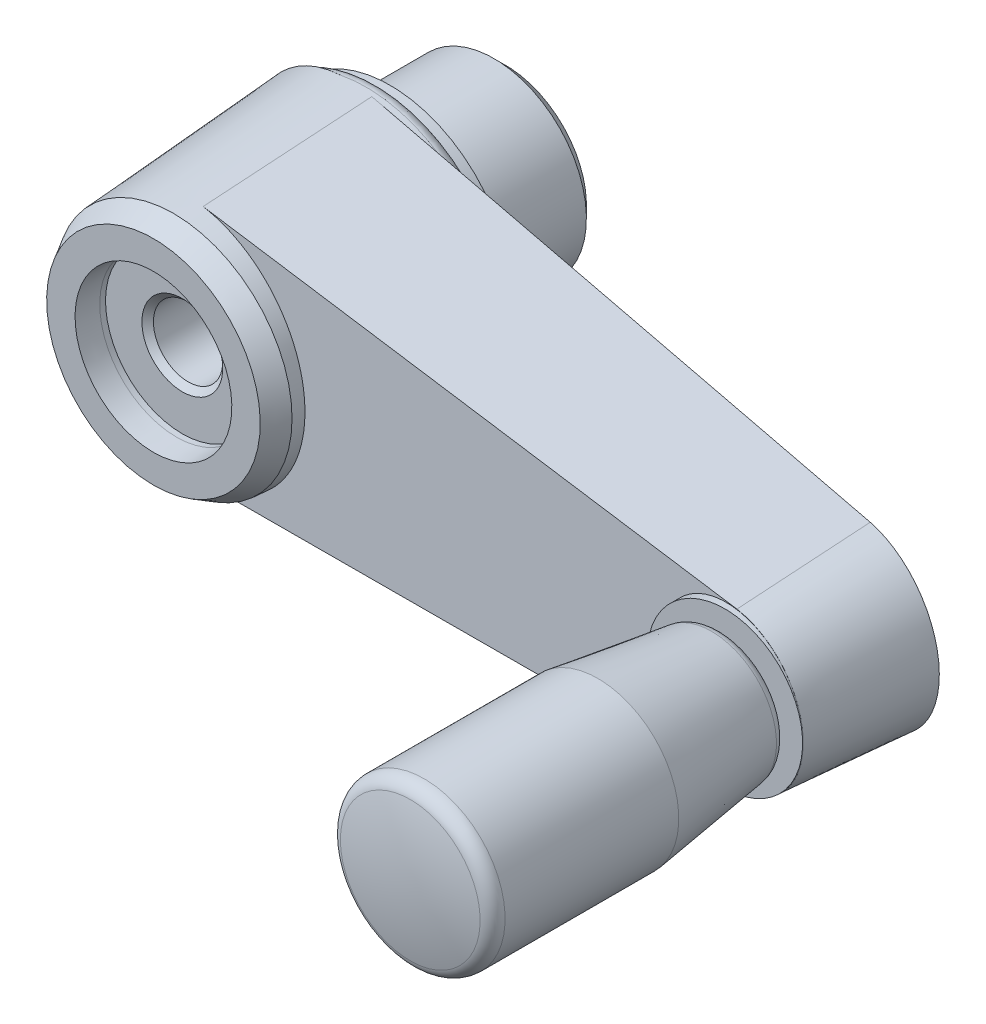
ISO-10303-21;
HEADER;
FILE_DESCRIPTION(('STEP AP214'),'2;1');
FILE_NAME('part.step','',(''),(''),'','','');
FILE_SCHEMA(('AUTOMOTIVE_DESIGN { 1 0 10303 214 1 1 1 1 }'));
ENDSEC;
DATA;
#1=APPLICATION_CONTEXT('core data for automotive mechanical design processes');
#2=APPLICATION_PROTOCOL_DEFINITION('international standard','automotive_design',2000,#1);
#3=PRODUCT_CONTEXT('',#1,'mechanical');
#4=PRODUCT('Part','Part','',(#3));
#5=PRODUCT_RELATED_PRODUCT_CATEGORY('part','',(#4));
#6=PRODUCT_DEFINITION_FORMATION('','',#4);
#7=PRODUCT_DEFINITION_CONTEXT('part definition',#1,'design');
#8=PRODUCT_DEFINITION('design','',#6,#7);
#9=PRODUCT_DEFINITION_SHAPE('','',#8);
#10=(LENGTH_UNIT() NAMED_UNIT(*) SI_UNIT(.MILLI.,.METRE.));
#11=(NAMED_UNIT(*) PLANE_ANGLE_UNIT() SI_UNIT($,.RADIAN.));
#12=(NAMED_UNIT(*) SI_UNIT($,.STERADIAN.) SOLID_ANGLE_UNIT());
#13=UNCERTAINTY_MEASURE_WITH_UNIT(LENGTH_MEASURE(1.E-05),#10,'distance_accuracy_value','');
#14=(GEOMETRIC_REPRESENTATION_CONTEXT(3) GLOBAL_UNCERTAINTY_ASSIGNED_CONTEXT((#13)) GLOBAL_UNIT_ASSIGNED_CONTEXT((#10,
#11,#12)) REPRESENTATION_CONTEXT('',''));
#15=CARTESIAN_POINT('',(0.,0.,0.));
#16=DIRECTION('',(0.,0.,1.));
#17=DIRECTION('',(1.,0.,0.));
#18=AXIS2_PLACEMENT_3D('',#15,#16,#17);
#19=CARTESIAN_POINT('',(-9.25,0.,30.4999999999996));
#20=DIRECTION('',(0.,0.,-1.));
#21=DIRECTION('',(0.,1.,0.));
#22=AXIS2_PLACEMENT_3D('',#19,#20,#21);
#23=PLANE('',#22);
#24=CARTESIAN_POINT('',(0.,0.,30.4999999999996));
#25=DIRECTION('',(0.,0.,1.));
#26=DIRECTION('',(0.,-1.,0.));
#27=AXIS2_PLACEMENT_3D('',#24,#25,#26);
#28=CIRCLE('',#27,9.25);
#29=CARTESIAN_POINT('',(0.,-9.25,30.4999999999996));
#30=VERTEX_POINT('',#29);
#31=EDGE_CURVE('E305',#30,#30,#28,.T.);
#32=ORIENTED_EDGE('',*,*,#31,.T.);
#33=EDGE_LOOP('',(#32));
#34=FACE_BOUND('',#33,.T.);
#35=CARTESIAN_POINT('',(0.,0.,30.4999999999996));
#36=DIRECTION('',(0.,0.,1.));
#37=DIRECTION('',(0.,-1.,0.));
#38=AXIS2_PLACEMENT_3D('',#35,#36,#37);
#39=CIRCLE('',#38,6.78985362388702);
#40=CARTESIAN_POINT('',(0.,-6.78985362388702,30.4999999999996));
#41=VERTEX_POINT('',#40);
#42=EDGE_CURVE('E329',#41,#41,#39,.T.);
#43=ORIENTED_EDGE('',*,*,#42,.F.);
#44=EDGE_LOOP('',(#43));
#45=FACE_BOUND('',#44,.T.);
#46=ADVANCED_FACE('F14',(#34,#45),#23,.F.);
#47=CARTESIAN_POINT('',(-11.5,-11.5,10.8686434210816));
#48=DIRECTION('',(-0.130237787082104,0.,0.99148278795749));
#49=DIRECTION('',(-0.99148278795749,0.,-0.130237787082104));
#50=AXIS2_PLACEMENT_3D('',#47,#48,#49);
#51=PLANE('',#50);
#52=CARTESIAN_POINT('',(-0.104670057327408,0.,12.3654949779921));
#53=DIRECTION('',(-0.130237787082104,0.,0.99148278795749));
#54=DIRECTION('',(-0.99148278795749,0.,-0.130237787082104));
#55=AXIS2_PLACEMENT_3D('',#52,#53,#54);
#56=ELLIPSE('',#55,11.4932201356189,11.394849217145);
#57=CARTESIAN_POINT('',(0.911596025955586,11.3494439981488,12.4989882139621));
#58=VERTEX_POINT('',#57);
#59=CARTESIAN_POINT('',(0.911596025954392,-11.3494439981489,12.4989882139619));
#60=VERTEX_POINT('',#59);
#61=EDGE_CURVE('E251',#58,#60,#56,.F.);
#62=ORIENTED_EDGE('',*,*,#61,.F.);
#63=DIRECTION('',(-0.988624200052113,0.0758813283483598,-0.129862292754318));
#64=VECTOR('',#63,1.);
#65=CARTESIAN_POINT('',(-9.71441205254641,12.1650376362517,11.1031921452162));
#66=LINE('',#65,#64);
#67=CARTESIAN_POINT('',(50.608289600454,7.53500052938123,19.0269758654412));
#68=VERTEX_POINT('',#67);
#69=EDGE_CURVE('E234',#68,#58,#66,.T.);
#70=ORIENTED_EDGE('',*,*,#69,.F.);
#71=CARTESIAN_POINT('',(49.930506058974,0.,18.9379445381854));
#72=DIRECTION('',(-0.130237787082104,0.,0.99148278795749));
#73=DIRECTION('',(-0.99148278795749,0.,-0.130237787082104));
#74=AXIS2_PLACEMENT_3D('',#71,#72,#73);
#75=ELLIPSE('',#74,7.63073206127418,7.56542032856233);
#76=CARTESIAN_POINT('',(50.608289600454,-7.53500052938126,19.0269758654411));
#77=VERTEX_POINT('',#76);
#78=EDGE_CURVE('E98',#68,#77,#75,.F.);
#79=ORIENTED_EDGE('',*,*,#78,.T.);
#80=DIRECTION('',(0.988624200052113,0.0758813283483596,0.129862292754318));
#81=VECTOR('',#80,1.);
#82=CARTESIAN_POINT('',(-11.4398287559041,-12.2974710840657,10.8765473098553));
#83=LINE('',#82,#81);
#84=EDGE_CURVE('E94',#77,#60,#83,.F.);
#85=ORIENTED_EDGE('',*,*,#84,.T.);
#86=EDGE_LOOP('',(#62,#70,#79,#85));
#87=FACE_BOUND('',#86,.T.);
#88=ADVANCED_FACE('F123',(#87),#51,.F.);
#89=CARTESIAN_POINT('',(56.7298365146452,-11.5,30.9460983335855));
#90=DIRECTION('',(0.0697564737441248,0.,-0.997564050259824));
#91=DIRECTION('',(0.997564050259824,0.,0.0697564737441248));
#92=AXIS2_PLACEMENT_3D('',#89,#90,#91);
#93=PLANE('',#92);
#94=CARTESIAN_POINT('',(-0.0507248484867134,0.,26.975614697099));
#95=DIRECTION('',(0.0697564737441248,0.,-0.997564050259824));
#96=DIRECTION('',(-0.997564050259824,0.,-0.0697564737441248));
#97=AXIS2_PLACEMENT_3D('',#94,#95,#96);
#98=ELLIPSE('',#97,10.3990223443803,10.3735668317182);
#99=CARTESIAN_POINT('',(0.836486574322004,-10.3355582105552,27.0376545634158));
#100=VERTEX_POINT('',#99);
#101=CARTESIAN_POINT('',(0.836486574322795,10.3355582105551,27.0376545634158));
#102=VERTEX_POINT('',#101);
#103=EDGE_CURVE('E84',#100,#102,#98,.F.);
#104=ORIENTED_EDGE('',*,*,#103,.F.);
#105=DIRECTION('',(-0.994968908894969,-0.072084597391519,-0.0695750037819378));
#106=VECTOR('',#105,1.);
#107=CARTESIAN_POINT('',(56.355888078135,-6.31322779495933,30.9199493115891));
#108=LINE('',#107,#106);
#109=CARTESIAN_POINT('',(50.5487553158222,-6.7339493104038,30.5138750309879));
#110=VERTEX_POINT('',#109);
#111=EDGE_CURVE('E232',#100,#110,#108,.F.);
#112=ORIENTED_EDGE('',*,*,#111,.T.);
#113=CARTESIAN_POINT('',(49.9669495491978,0.,30.4731912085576));
#114=DIRECTION('',(0.0697564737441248,0.,-0.997564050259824));
#115=DIRECTION('',(-0.997564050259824,0.,-0.0697564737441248));
#116=AXIS2_PLACEMENT_3D('',#113,#114,#115);
#117=ELLIPSE('',#116,6.77562154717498,6.7590356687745);
#118=CARTESIAN_POINT('',(56.7191173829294,-0.306403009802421,30.9453487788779));
#119=VERTEX_POINT('',#118);
#120=EDGE_CURVE('E229',#110,#119,#117,.F.);
#121=ORIENTED_EDGE('',*,*,#120,.T.);
#122=CARTESIAN_POINT('',(50.,0.,30.4755023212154));
#123=DIRECTION('',(0.0697564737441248,0.,-0.997564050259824));
#124=DIRECTION('',(0.997564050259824,0.,0.0697564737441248));
#125=AXIS2_PLACEMENT_3D('',#122,#123,#124);
#126=ELLIPSE('',#125,6.74252445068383,6.7261);
#127=CARTESIAN_POINT('',(56.719117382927,0.306403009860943,30.9453487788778));
#128=VERTEX_POINT('',#127);
#129=EDGE_CURVE('E93',#119,#128,#126,.T.);
#130=ORIENTED_EDGE('',*,*,#129,.T.);
#131=CARTESIAN_POINT('',(50.5487553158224,6.73394931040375,30.5138750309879));
#132=VERTEX_POINT('',#131);
#133=EDGE_CURVE('E228',#128,#132,#117,.F.);
#134=ORIENTED_EDGE('',*,*,#133,.T.);
#135=DIRECTION('',(0.994968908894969,-0.0720845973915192,0.0695750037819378));
#136=VECTOR('',#135,1.);
#137=CARTESIAN_POINT('',(58.0054925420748,6.19371544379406,31.0353008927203));
#138=LINE('',#137,#136);
#139=EDGE_CURVE('E225',#102,#132,#138,.T.);
#140=ORIENTED_EDGE('',*,*,#139,.F.);
#141=EDGE_LOOP('',(#104,#112,#121,#130,#134,#140));
#142=FACE_BOUND('',#141,.T.);
#143=ADVANCED_FACE('F182',(#142),#93,.F.);
#144=CARTESIAN_POINT('',(0.,0.,10.8686434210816));
#145=DIRECTION('',(0.,0.,-1.));
#146=DIRECTION('',(0.,-1.,0.));
#147=AXIS2_PLACEMENT_3D('',#144,#145,#146);
#148=CONICAL_SURFACE('',#147,11.5,0.0698131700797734);
#149=CARTESIAN_POINT('',(-0.104670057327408,0.,12.3654949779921));
#150=DIRECTION('',(-0.130237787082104,0.,0.99148278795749));
#151=DIRECTION('',(-0.99148278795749,0.,-0.130237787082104));
#152=AXIS2_PLACEMENT_3D('',#149,#150,#151);
#153=ELLIPSE('',#152,11.4932201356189,11.3948492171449);
#154=CARTESIAN_POINT('',(-2.2077738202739,-11.1991033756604,12.089238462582));
#155=VERTEX_POINT('',#154);
#156=CARTESIAN_POINT('',(-2.2077738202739,11.1991033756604,12.089238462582));
#157=VERTEX_POINT('',#156);
#158=EDGE_CURVE('E90',#155,#157,#153,.F.);
#159=ORIENTED_EDGE('',*,*,#158,.F.);
#160=CARTESIAN_POINT('',(0.,0.,12.089238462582));
#161=DIRECTION('',(0.,0.,1.));
#162=DIRECTION('',(0.,-1.,0.));
#163=AXIS2_PLACEMENT_3D('',#160,#161,#162);
#164=CIRCLE('',#163,11.4146476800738);
#165=EDGE_CURVE('E80',#155,#157,#164,.T.);
#166=ORIENTED_EDGE('',*,*,#165,.T.);
#167=EDGE_LOOP('',(#159,#166));
#168=FACE_BOUND('',#167,.T.);
#169=CARTESIAN_POINT('',(0.816240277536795,10.0629979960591,30.9460983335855));
#170=CARTESIAN_POINT('',(0.833583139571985,10.2963518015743,27.5998558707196));
#171=CARTESIAN_POINT('',(0.850901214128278,10.5297072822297,24.2536133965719));
#172=CARTESIAN_POINT('',(0.885487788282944,10.9964215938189,17.5611284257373));
#173=CARTESIAN_POINT('',(0.902756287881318,11.2297804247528,14.2148859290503));
#174=CARTESIAN_POINT('',(0.920000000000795,11.4631409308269,10.8686434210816));
#175=B_SPLINE_CURVE_WITH_KNOTS('',3,(#169,#170,#171,#172,#173,#174),.UNSPECIFIED.,.F.,.F.,(4,2,
4),(0.,10.0632420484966,20.1264840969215),.UNSPECIFIED.);
#176=EDGE_CURVE('E194',#102,#58,#175,.T.);
#177=ORIENTED_EDGE('',*,*,#176,.T.);
#178=ORIENTED_EDGE('',*,*,#61,.T.);
#179=CARTESIAN_POINT('',(0.816240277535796,-10.0629979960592,30.9460983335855));
#180=CARTESIAN_POINT('',(0.833583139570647,-10.2963518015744,27.5998558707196));
#181=CARTESIAN_POINT('',(0.850901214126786,-10.5297072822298,24.2536133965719));
#182=CARTESIAN_POINT('',(0.885487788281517,-10.9964215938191,17.5611284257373));
#183=CARTESIAN_POINT('',(0.902756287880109,-11.229780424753,14.2148859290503));
#184=CARTESIAN_POINT('',(0.91999999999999,-11.463140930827,10.8686434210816));
#185=B_SPLINE_CURVE_WITH_KNOTS('',3,(#179,#180,#181,#182,#183,#184),.UNSPECIFIED.,.F.,.F.,(4,2,
4),(0.,10.0632420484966,20.1264840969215),.UNSPECIFIED.);
#186=EDGE_CURVE('E187',#100,#60,#185,.T.);
#187=ORIENTED_EDGE('',*,*,#186,.F.);
#188=ORIENTED_EDGE('',*,*,#103,.T.);
#189=EDGE_LOOP('',(#177,#178,#187,#188));
#190=FACE_BOUND('',#189,.T.);
#191=CARTESIAN_POINT('',(0.,0.,28.7444762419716));
#192=DIRECTION('',(0.,0.,1.));
#193=DIRECTION('',(0.,-1.,0.));
#194=AXIS2_PLACEMENT_3D('',#191,#192,#193);
#195=CIRCLE('',#194,10.25);
#196=CARTESIAN_POINT('',(0.,-10.25,28.7444762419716));
#197=VERTEX_POINT('',#196);
#198=EDGE_CURVE('E91',#197,#197,#195,.T.);
#199=ORIENTED_EDGE('',*,*,#198,.F.);
#200=EDGE_LOOP('',(#199));
#201=FACE_BOUND('',#200,.T.);
#202=ADVANCED_FACE('F88',(#168,#190,#201),#148,.T.);
#203=CARTESIAN_POINT('',(0.91999999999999,-11.4631409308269,10.8686434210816));
#204=DIRECTION('',(0.0672304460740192,-0.995295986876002,0.0697564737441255));
#205=DIRECTION('',(0.,-0.0699146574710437,-0.997552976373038));
#206=AXIS2_PLACEMENT_3D('',#203,#204,#205);
#207=PLANE('',#206);
#208=ORIENTED_EDGE('',*,*,#111,.F.);
#209=ORIENTED_EDGE('',*,*,#186,.T.);
#210=ORIENTED_EDGE('',*,*,#84,.F.);
#211=CARTESIAN_POINT('',(50.5465090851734,-6.70380816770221,30.9460983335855));
#212=CARTESIAN_POINT('',(50.5682362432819,-6.99540068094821,26.7646715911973));
#213=CARTESIAN_POINT('',(50.5899069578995,-7.28699700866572,22.5832448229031));
#214=CARTESIAN_POINT('',(50.6245011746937,-7.75371080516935,15.8907598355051));
#215=CARTESIAN_POINT('',(50.6374607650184,-7.9288258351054,13.3797016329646));
#216=CARTESIAN_POINT('',(50.6504,-8.10394224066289,10.8686434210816));
#217=B_SPLINE_CURVE_WITH_KNOTS('',3,(#211,#212,#213,#214,#215,#216),.UNSPECIFIED.,.F.,.F.,(4,2,
4),(0.,12.5749135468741,20.1264841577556),.UNSPECIFIED.);
#218=EDGE_CURVE('E218',#110,#77,#217,.T.);
#219=ORIENTED_EDGE('',*,*,#218,.F.);
#220=EDGE_LOOP('',(#208,#209,#210,#219));
#221=FACE_BOUND('',#220,.T.);
#222=ADVANCED_FACE('F181',(#221),#207,.T.);
#223=CARTESIAN_POINT('',(50.,0.,10.8686434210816));
#224=DIRECTION('',(0.,0.,-1.));
#225=DIRECTION('',(0.,-1.,0.));
#226=AXIS2_PLACEMENT_3D('',#223,#224,#225);
#227=CONICAL_SURFACE('',#226,8.13,0.0698131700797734);
#228=ORIENTED_EDGE('',*,*,#133,.F.);
#229=CARTESIAN_POINT('',(50.,0.,30.9453487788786));
#230=DIRECTION('',(0.,0.,-1.));
#231=DIRECTION('',(0.,1.,0.));
#232=AXIS2_PLACEMENT_3D('',#229,#230,#231);
#233=CIRCLE('',#232,6.7261);
#234=EDGE_CURVE('E42',#128,#119,#233,.T.);
#235=ORIENTED_EDGE('',*,*,#234,.T.);
#236=ORIENTED_EDGE('',*,*,#120,.F.);
#237=ORIENTED_EDGE('',*,*,#218,.T.);
#238=ORIENTED_EDGE('',*,*,#78,.F.);
#239=CARTESIAN_POINT('',(50.5465090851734,6.70380816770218,30.9460983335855));
#240=CARTESIAN_POINT('',(50.5682362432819,6.99540068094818,26.7646715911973));
#241=CARTESIAN_POINT('',(50.5899069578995,7.28699700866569,22.5832448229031));
#242=CARTESIAN_POINT('',(50.6245011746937,7.75371080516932,15.8907598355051));
#243=CARTESIAN_POINT('',(50.6374607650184,7.92882583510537,13.3797016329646));
#244=CARTESIAN_POINT('',(50.6504,8.10394224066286,10.8686434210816));
#245=B_SPLINE_CURVE_WITH_KNOTS('',3,(#239,#240,#241,#242,#243,#244),.UNSPECIFIED.,.F.,.F.,(4,2,
4),(0.,12.5749135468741,20.1264841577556),.UNSPECIFIED.);
#246=EDGE_CURVE('E201',#132,#68,#245,.T.);
#247=ORIENTED_EDGE('',*,*,#246,.F.);
#248=EDGE_LOOP('',(#228,#235,#236,#237,#238,#247));
#249=FACE_BOUND('',#248,.T.);
#250=ADVANCED_FACE('F211',(#249),#227,.T.);
#251=CARTESIAN_POINT('',(0.91999999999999,11.4631409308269,10.8686434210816));
#252=DIRECTION('',(0.0672304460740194,0.995295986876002,0.0697564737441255));
#253=DIRECTION('',(0.,-0.0699146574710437,0.997552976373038));
#254=AXIS2_PLACEMENT_3D('',#251,#252,#253);
#255=PLANE('',#254);
#256=ORIENTED_EDGE('',*,*,#176,.F.);
#257=ORIENTED_EDGE('',*,*,#139,.T.);
#258=ORIENTED_EDGE('',*,*,#246,.T.);
#259=ORIENTED_EDGE('',*,*,#69,.T.);
#260=EDGE_LOOP('',(#256,#257,#258,#259));
#261=FACE_BOUND('',#260,.T.);
#262=ADVANCED_FACE('F208',(#261),#255,.T.);
#263=CARTESIAN_POINT('',(0.,0.,12.3792440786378));
#264=DIRECTION('',(-0.130237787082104,0.,0.99148278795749));
#265=DIRECTION('',(0.99148278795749,0.,0.130237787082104));
#266=AXIS2_PLACEMENT_3D('',#263,#264,#265);
#267=ELLIPSE('',#266,10.5901989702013,10.4999999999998);
#268=CARTESIAN_POINT('',(-10.3254713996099,-1.90647328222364,11.0229254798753));
#269=VERTEX_POINT('',#268);
#270=CARTESIAN_POINT('',(-10.3254713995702,1.90647328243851,11.0229254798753));
#271=VERTEX_POINT('',#270);
#272=EDGE_CURVE('E28',#269,#271,#267,.F.);
#273=ORIENTED_EDGE('',*,*,#272,.F.);
#274=CARTESIAN_POINT('',(-10.2868458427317,0.,11.0279992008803));
#275=CARTESIAN_POINT('',(-10.2889229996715,-0.0186180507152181,11.0277263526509));
#276=CARTESIAN_POINT('',(-10.2909504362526,-0.037242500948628,11.0274600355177));
#277=CARTESIAN_POINT('',(-10.328292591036,-0.389018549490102,11.0225548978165));
#278=CARTESIAN_POINT('',(-10.3477502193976,-0.724105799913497,11.0199990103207));
#279=CARTESIAN_POINT('',(-10.3545534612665,-1.39492341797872,11.0191053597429));
#280=CARTESIAN_POINT('',(-10.341851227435,-1.73065400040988,11.0207738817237));
#281=CARTESIAN_POINT('',(-10.2630896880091,-2.64423253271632,11.0311197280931));
#282=CARTESIAN_POINT('',(-10.1648024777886,-3.21958493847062,11.044030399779));
#283=CARTESIAN_POINT('',(-9.87339886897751,-4.34599471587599,11.0823081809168));
#284=CARTESIAN_POINT('',(-9.68019036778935,-4.89702792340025,11.1076873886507));
#285=CARTESIAN_POINT('',(-9.32372276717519,-5.69192330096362,11.1545117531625));
#286=CARTESIAN_POINT('',(-9.19387776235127,-5.95148315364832,11.1715677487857));
#287=CARTESIAN_POINT('',(-8.91281276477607,-6.45851450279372,11.2084874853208));
#288=CARTESIAN_POINT('',(-8.76160056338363,-6.7059903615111,11.2283502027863));
#289=CARTESIAN_POINT('',(-8.43881444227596,-7.18704333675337,11.2707502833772));
#290=CARTESIAN_POINT('',(-8.26723934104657,-7.42061964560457,11.2932878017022));
#291=CARTESIAN_POINT('',(-7.90498341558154,-7.87204819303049,11.3408725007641));
#292=CARTESIAN_POINT('',(-7.71430968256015,-8.08990621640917,11.3659187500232));
#293=CARTESIAN_POINT('',(-7.31726644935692,-8.50610364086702,11.4180729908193));
#294=CARTESIAN_POINT('',(-7.1110854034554,-8.70462595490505,11.4451562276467));
#295=CARTESIAN_POINT('',(-6.6827093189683,-9.08324402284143,11.5014262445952));
#296=CARTESIAN_POINT('',(-6.46051433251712,-9.2633398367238,11.5306130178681));
#297=CARTESIAN_POINT('',(-6.00167551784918,-9.60370566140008,11.5908845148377));
#298=CARTESIAN_POINT('',(-5.76503215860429,-9.76397631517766,11.6219691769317));
#299=CARTESIAN_POINT('',(-5.27897465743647,-10.0634190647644,11.6858160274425));
#300=CARTESIAN_POINT('',(-5.02956099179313,-10.2025919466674,11.7185781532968));
#301=CARTESIAN_POINT('',(-4.52357238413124,-10.456772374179,11.7850430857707));
#302=CARTESIAN_POINT('',(-4.2671609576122,-10.5721110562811,11.8187244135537));
#303=CARTESIAN_POINT('',(-3.74549893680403,-10.7802282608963,11.8872481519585));
#304=CARTESIAN_POINT('',(-3.4802487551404,-10.8730078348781,11.9220905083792));
#305=CARTESIAN_POINT('',(-2.94240262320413,-11.0352705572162,11.9927401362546));
#306=CARTESIAN_POINT('',(-2.66979649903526,-11.1047194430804,12.0285487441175));
#307=CARTESIAN_POINT('',(-2.1195682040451,-11.2194337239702,12.1008248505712));
#308=CARTESIAN_POINT('',(-1.84194493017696,-11.2646937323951,12.1372924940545));
#309=CARTESIAN_POINT('',(-1.56285300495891,-11.297493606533,12.1739530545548));
#310=B_SPLINE_CURVE_WITH_KNOTS('',3,(#274,#275,#276,#277,#278,#279,#280,#281,#282,#283,#284,
#285,#286,#287,#288,#289,#290,#291,#292,#293,#294,#295,#296,#297,#298,#299,#300,#301,#302,#303,
#304,#305,#306,#307,#308,#309),.UNSPECIFIED.,.F.,.F.,(4,2,2,2,2,2,2,2,2,2,2,2,2,2,2,2,2,4),(0.,
0.0562087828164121,1.06131769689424,2.06792288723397,3.81068822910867,5.55514793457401,
6.42645227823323,7.29743972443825,8.16847773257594,9.03919351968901,9.90065083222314,
10.7621053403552,11.6235319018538,12.4849263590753,13.3334011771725,14.1818364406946,
15.0315122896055,15.8813772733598),.UNSPECIFIED.);
#311=EDGE_CURVE('E9',#269,#155,#310,.T.);
#312=ORIENTED_EDGE('',*,*,#311,.T.);
#313=ORIENTED_EDGE('',*,*,#158,.T.);
#314=CARTESIAN_POINT('',(-10.2868458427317,0.,11.0279992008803));
#315=CARTESIAN_POINT('',(-10.2889229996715,0.0186180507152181,11.0277263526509));
#316=CARTESIAN_POINT('',(-10.2909504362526,0.037242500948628,11.0274600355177));
#317=CARTESIAN_POINT('',(-10.328292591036,0.389018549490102,11.0225548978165));
#318=CARTESIAN_POINT('',(-10.3477502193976,0.724105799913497,11.0199990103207));
#319=CARTESIAN_POINT('',(-10.3545534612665,1.39492341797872,11.0191053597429));
#320=CARTESIAN_POINT('',(-10.341851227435,1.73065400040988,11.0207738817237));
#321=CARTESIAN_POINT('',(-10.2630896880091,2.64423253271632,11.0311197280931));
#322=CARTESIAN_POINT('',(-10.1648024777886,3.21958493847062,11.044030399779));
#323=CARTESIAN_POINT('',(-9.87339886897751,4.34599471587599,11.0823081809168));
#324=CARTESIAN_POINT('',(-9.68019036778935,4.89702792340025,11.1076873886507));
#325=CARTESIAN_POINT('',(-9.32372276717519,5.69192330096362,11.1545117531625));
#326=CARTESIAN_POINT('',(-9.19387776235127,5.95148315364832,11.1715677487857));
#327=CARTESIAN_POINT('',(-8.91281276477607,6.45851450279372,11.2084874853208));
#328=CARTESIAN_POINT('',(-8.76160056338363,6.7059903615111,11.2283502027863));
#329=CARTESIAN_POINT('',(-8.43881444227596,7.18704333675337,11.2707502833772));
#330=CARTESIAN_POINT('',(-8.26723934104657,7.42061964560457,11.2932878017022));
#331=CARTESIAN_POINT('',(-7.90498341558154,7.87204819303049,11.3408725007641));
#332=CARTESIAN_POINT('',(-7.71430968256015,8.08990621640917,11.3659187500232));
#333=CARTESIAN_POINT('',(-7.31726644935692,8.50610364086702,11.4180729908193));
#334=CARTESIAN_POINT('',(-7.1110854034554,8.70462595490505,11.4451562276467));
#335=CARTESIAN_POINT('',(-6.6827093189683,9.08324402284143,11.5014262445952));
#336=CARTESIAN_POINT('',(-6.46051433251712,9.2633398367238,11.5306130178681));
#337=CARTESIAN_POINT('',(-6.00167551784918,9.60370566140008,11.5908845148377));
#338=CARTESIAN_POINT('',(-5.76503215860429,9.76397631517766,11.6219691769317));
#339=CARTESIAN_POINT('',(-5.27897465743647,10.0634190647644,11.6858160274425));
#340=CARTESIAN_POINT('',(-5.02956099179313,10.2025919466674,11.7185781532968));
#341=CARTESIAN_POINT('',(-4.52357238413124,10.456772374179,11.7850430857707));
#342=CARTESIAN_POINT('',(-4.2671609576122,10.5721110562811,11.8187244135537));
#343=CARTESIAN_POINT('',(-3.74549893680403,10.7802282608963,11.8872481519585));
#344=CARTESIAN_POINT('',(-3.4802487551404,10.8730078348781,11.9220905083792));
#345=CARTESIAN_POINT('',(-2.94240262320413,11.0352705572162,11.9927401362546));
#346=CARTESIAN_POINT('',(-2.66979649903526,11.1047194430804,12.0285487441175));
#347=CARTESIAN_POINT('',(-2.1195682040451,11.2194337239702,12.1008248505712));
#348=CARTESIAN_POINT('',(-1.84194493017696,11.2646937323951,12.1372924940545));
#349=CARTESIAN_POINT('',(-1.56285300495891,11.297493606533,12.1739530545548));
#350=B_SPLINE_CURVE_WITH_KNOTS('',3,(#314,#315,#316,#317,#318,#319,#320,#321,#322,#323,#324,
#325,#326,#327,#328,#329,#330,#331,#332,#333,#334,#335,#336,#337,#338,#339,#340,#341,#342,#343,
#344,#345,#346,#347,#348,#349),.UNSPECIFIED.,.F.,.F.,(4,2,2,2,2,2,2,2,2,2,2,2,2,2,2,2,2,4),(0.,
0.0562087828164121,1.06131769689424,2.06792288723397,3.81068822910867,5.55514793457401,
6.42645227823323,7.29743972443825,8.16847773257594,9.03919351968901,9.90065083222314,
10.7621053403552,11.6235319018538,12.4849263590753,13.3334011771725,14.1818364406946,
15.0315122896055,15.8813772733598),.UNSPECIFIED.);
#351=EDGE_CURVE('E77',#157,#271,#350,.F.);
#352=ORIENTED_EDGE('',*,*,#351,.T.);
#353=EDGE_LOOP('',(#273,#312,#313,#352));
#354=FACE_BOUND('',#353,.T.);
#355=ADVANCED_FACE('F16',(#354),#51,.F.);
#356=CARTESIAN_POINT('',(50.,0.,59.));
#357=DIRECTION('',(0.,0.,1.));
#358=DIRECTION('',(-1.,0.,0.));
#359=AXIS2_PLACEMENT_3D('',#356,#357,#358);
#360=CYLINDRICAL_SURFACE('',#359,6.7261);
#361=CARTESIAN_POINT('',(50.,0.,30.9999999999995));
#362=DIRECTION('',(0.,0.,1.));
#363=DIRECTION('',(-1.,0.,0.));
#364=AXIS2_PLACEMENT_3D('',#361,#362,#363);
#365=CIRCLE('',#364,6.7261);
#366=CARTESIAN_POINT('',(43.2739,0.,30.9999999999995));
#367=VERTEX_POINT('',#366);
#368=EDGE_CURVE('E252',#367,#367,#365,.T.);
#369=ORIENTED_EDGE('',*,*,#368,.F.);
#370=EDGE_LOOP('',(#369));
#371=FACE_BOUND('',#370,.T.);
#372=ORIENTED_EDGE('',*,*,#234,.F.);
#373=ORIENTED_EDGE('',*,*,#129,.F.);
#374=EDGE_LOOP('',(#372,#373));
#375=FACE_BOUND('',#374,.T.);
#376=ADVANCED_FACE('F143',(#371,#375),#360,.T.);
#377=CARTESIAN_POINT('',(50.,0.,33.9999999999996));
#378=DIRECTION('',(0.,-1.,0.));
#379=DIRECTION('',(1.,0.,0.));
#380=AXIS2_PLACEMENT_3D('',#377,#378,#379);
#381=SPHERICAL_SURFACE('',#380,25.);
#382=CARTESIAN_POINT('',(50.,0.,33.9999999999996));
#383=DIRECTION('',(0.,0.,1.));
#384=DIRECTION('',(-1.,0.,0.));
#385=AXIS2_PLACEMENT_3D('',#382,#383,#384);
#386=SPHERICAL_SURFACE('',#385,25.);
#387=CARTESIAN_POINT('',(50.,0.,58.2562497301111));
#388=DIRECTION('',(0.,0.,1.));
#389=DIRECTION('',(-1.,0.,0.));
#390=AXIS2_PLACEMENT_3D('',#387,#388,#389);
#391=CIRCLE('',#390,6.05263157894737);
#392=CARTESIAN_POINT('',(43.9473684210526,0.,58.2562497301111));
#393=VERTEX_POINT('',#392);
#394=EDGE_CURVE('E280',#393,#393,#391,.T.);
#395=ORIENTED_EDGE('',*,*,#394,.T.);
#396=EDGE_LOOP('',(#395));
#397=FACE_BOUND('',#396,.T.);
#398=ADVANCED_FACE('F146',(#397),#386,.T.);
#399=CARTESIAN_POINT('',(50.,0.,57.0434372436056));
#400=DIRECTION('',(0.,0.,1.));
#401=DIRECTION('',(-1.,0.,0.));
#402=AXIS2_PLACEMENT_3D('',#399,#400,#401);
#403=TOROIDAL_SURFACE('',#402,5.75,1.25);
#404=CARTESIAN_POINT('',(50.,0.,57.0434372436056));
#405=DIRECTION('',(0.,0.,1.));
#406=DIRECTION('',(-1.,0.,0.));
#407=AXIS2_PLACEMENT_3D('',#404,#405,#406);
#408=CIRCLE('',#407,7.);
#409=CARTESIAN_POINT('',(43.,0.,57.0434372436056));
#410=VERTEX_POINT('',#409);
#411=EDGE_CURVE('E277',#410,#410,#408,.T.);
#412=ORIENTED_EDGE('',*,*,#411,.T.);
#413=EDGE_LOOP('',(#412));
#414=FACE_BOUND('',#413,.T.);
#415=ORIENTED_EDGE('',*,*,#394,.F.);
#416=EDGE_LOOP('',(#415));
#417=FACE_BOUND('',#416,.T.);
#418=ADVANCED_FACE('F170',(#414,#417),#403,.T.);
#419=CARTESIAN_POINT('',(50.,0.,59.));
#420=DIRECTION('',(0.,0.,1.));
#421=DIRECTION('',(-1.,0.,0.));
#422=AXIS2_PLACEMENT_3D('',#419,#420,#421);
#423=CYLINDRICAL_SURFACE('',#422,7.);
#424=ORIENTED_EDGE('',*,*,#411,.F.);
#425=EDGE_LOOP('',(#424));
#426=FACE_BOUND('',#425,.T.);
#427=CARTESIAN_POINT('',(50.,0.,41.9999999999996));
#428=DIRECTION('',(0.,0.,1.));
#429=DIRECTION('',(-1.,0.,0.));
#430=AXIS2_PLACEMENT_3D('',#427,#428,#429);
#431=CIRCLE('',#430,7.00000000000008);
#432=CARTESIAN_POINT('',(42.9999999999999,0.,41.9999999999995));
#433=VERTEX_POINT('',#432);
#434=EDGE_CURVE('E274',#433,#433,#431,.T.);
#435=ORIENTED_EDGE('',*,*,#434,.T.);
#436=EDGE_LOOP('',(#435));
#437=FACE_BOUND('',#436,.T.);
#438=ADVANCED_FACE('F166',(#426,#437),#423,.T.);
#439=CARTESIAN_POINT('',(50.,0.,41.9999999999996));
#440=DIRECTION('',(0.,0.,1.));
#441=DIRECTION('',(-1.,0.,0.));
#442=AXIS2_PLACEMENT_3D('',#439,#440,#441);
#443=CONICAL_SURFACE('',#442,7.00000000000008,0.139279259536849);
#444=CARTESIAN_POINT('',(50.,0.,32.1611706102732));
#445=DIRECTION('',(0.,0.,1.));
#446=DIRECTION('',(-1.,0.,0.));
#447=AXIS2_PLACEMENT_3D('',#444,#445,#446);
#448=CIRCLE('',#447,5.62072485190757);
#449=CARTESIAN_POINT('',(44.3792751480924,0.,32.1611706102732));
#450=VERTEX_POINT('',#449);
#451=EDGE_CURVE('E271',#450,#450,#448,.T.);
#452=ORIENTED_EDGE('',*,*,#451,.T.);
#453=EDGE_LOOP('',(#452));
#454=FACE_BOUND('',#453,.T.);
#455=ORIENTED_EDGE('',*,*,#434,.F.);
#456=EDGE_LOOP('',(#455));
#457=FACE_BOUND('',#456,.T.);
#458=ADVANCED_FACE('F162',(#454,#457),#443,.T.);
#459=CARTESIAN_POINT('',(50.,0.,32.2999999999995));
#460=DIRECTION('',(0.,0.,1.));
#461=DIRECTION('',(-1.,0.,0.));
#462=AXIS2_PLACEMENT_3D('',#459,#460,#461);
#463=TOROIDAL_SURFACE('',#462,4.63040853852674,1.);
#464=CARTESIAN_POINT('',(50.,0.,31.2999999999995));
#465=DIRECTION('',(0.,0.,1.));
#466=DIRECTION('',(-1.,0.,0.));
#467=AXIS2_PLACEMENT_3D('',#464,#465,#466);
#468=CIRCLE('',#467,4.63040853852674);
#469=CARTESIAN_POINT('',(45.3695914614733,0.,31.2999999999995));
#470=VERTEX_POINT('',#469);
#471=EDGE_CURVE('E268',#470,#470,#468,.T.);
#472=ORIENTED_EDGE('',*,*,#471,.T.);
#473=EDGE_LOOP('',(#472));
#474=FACE_BOUND('',#473,.T.);
#475=ORIENTED_EDGE('',*,*,#451,.F.);
#476=EDGE_LOOP('',(#475));
#477=FACE_BOUND('',#476,.T.);
#478=ADVANCED_FACE('F158',(#474,#477),#463,.T.);
#479=CARTESIAN_POINT('',(46.0739,0.,31.2999999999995));
#480=DIRECTION('',(0.,0.,1.));
#481=DIRECTION('',(-1.,0.,0.));
#482=AXIS2_PLACEMENT_3D('',#479,#480,#481);
#483=PLANE('',#482);
#484=ORIENTED_EDGE('',*,*,#471,.F.);
#485=EDGE_LOOP('',(#484));
#486=FACE_BOUND('',#485,.T.);
#487=CARTESIAN_POINT('',(50.,0.,31.2999999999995));
#488=DIRECTION('',(0.,0.,1.));
#489=DIRECTION('',(-1.,0.,0.));
#490=AXIS2_PLACEMENT_3D('',#487,#488,#489);
#491=CIRCLE('',#490,3.9261);
#492=CARTESIAN_POINT('',(46.0739,0.,31.2999999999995));
#493=VERTEX_POINT('',#492);
#494=EDGE_CURVE('E265',#493,#493,#491,.T.);
#495=ORIENTED_EDGE('',*,*,#494,.T.);
#496=EDGE_LOOP('',(#495));
#497=FACE_BOUND('',#496,.T.);
#498=ADVANCED_FACE('F154',(#486,#497),#483,.F.);
#499=CARTESIAN_POINT('',(50.,0.,59.));
#500=DIRECTION('',(0.,0.,1.));
#501=DIRECTION('',(-1.,0.,0.));
#502=AXIS2_PLACEMENT_3D('',#499,#500,#501);
#503=CYLINDRICAL_SURFACE('',#502,3.9261);
#504=CARTESIAN_POINT('',(50.,0.,30.9999999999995));
#505=DIRECTION('',(0.,0.,1.));
#506=DIRECTION('',(-1.,0.,0.));
#507=AXIS2_PLACEMENT_3D('',#504,#505,#506);
#508=CIRCLE('',#507,3.9261);
#509=CARTESIAN_POINT('',(46.0739,0.,30.9999999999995));
#510=VERTEX_POINT('',#509);
#511=EDGE_CURVE('E256',#510,#510,#508,.T.);
#512=ORIENTED_EDGE('',*,*,#511,.T.);
#513=EDGE_LOOP('',(#512));
#514=FACE_BOUND('',#513,.T.);
#515=ORIENTED_EDGE('',*,*,#494,.F.);
#516=EDGE_LOOP('',(#515));
#517=FACE_BOUND('',#516,.T.);
#518=ADVANCED_FACE('F150',(#514,#517),#503,.T.);
#519=CARTESIAN_POINT('',(43.2739,0.,30.9999999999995));
#520=DIRECTION('',(0.,0.,-1.));
#521=DIRECTION('',(1.,0.,0.));
#522=AXIS2_PLACEMENT_3D('',#519,#520,#521);
#523=PLANE('',#522);
#524=ORIENTED_EDGE('',*,*,#511,.F.);
#525=EDGE_LOOP('',(#524));
#526=FACE_BOUND('',#525,.T.);
#527=ORIENTED_EDGE('',*,*,#368,.T.);
#528=EDGE_LOOP('',(#527));
#529=FACE_BOUND('',#528,.T.);
#530=ADVANCED_FACE('F119',(#526,#529),#523,.F.);
#531=CARTESIAN_POINT('',(0.,0.,28.7444762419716));
#532=DIRECTION('',(0.,0.,-1.));
#533=DIRECTION('',(0.,1.,0.));
#534=AXIS2_PLACEMENT_3D('',#531,#532,#533);
#535=CONICAL_SURFACE('',#534,10.25,0.517789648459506);
#536=ORIENTED_EDGE('',*,*,#31,.F.);
#537=EDGE_LOOP('',(#536));
#538=FACE_BOUND('',#537,.T.);
#539=ORIENTED_EDGE('',*,*,#198,.T.);
#540=EDGE_LOOP('',(#539));
#541=FACE_BOUND('',#540,.T.);
#542=ADVANCED_FACE('F115',(#538,#541),#535,.T.);
#543=CARTESIAN_POINT('',(0.,0.,30.4999999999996));
#544=DIRECTION('',(0.,0.,1.));
#545=DIRECTION('',(0.,-1.,0.));
#546=AXIS2_PLACEMENT_3D('',#543,#544,#545);
#547=CYLINDRICAL_SURFACE('',#546,10.4999999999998);
#548=CARTESIAN_POINT('',(0.,0.,9.99999999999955));
#549=DIRECTION('',(0.,0.,1.));
#550=DIRECTION('',(0.,-1.,0.));
#551=AXIS2_PLACEMENT_3D('',#548,#549,#550);
#552=CIRCLE('',#551,10.4999999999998);
#553=CARTESIAN_POINT('',(0.,-10.4999999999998,9.99999999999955));
#554=VERTEX_POINT('',#553);
#555=EDGE_CURVE('E253',#554,#554,#552,.T.);
#556=ORIENTED_EDGE('',*,*,#555,.T.);
#557=EDGE_LOOP('',(#556));
#558=FACE_BOUND('',#557,.T.);
#559=CARTESIAN_POINT('',(0.,0.,11.0229254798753));
#560=DIRECTION('',(0.,0.,1.));
#561=DIRECTION('',(0.,-1.,0.));
#562=AXIS2_PLACEMENT_3D('',#559,#560,#561);
#563=CIRCLE('',#562,10.4999999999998);
#564=EDGE_CURVE('E35',#269,#271,#563,.T.);
#565=ORIENTED_EDGE('',*,*,#564,.F.);
#566=ORIENTED_EDGE('',*,*,#272,.T.);
#567=EDGE_LOOP('',(#565,#566));
#568=FACE_BOUND('',#567,.T.);
#569=ADVANCED_FACE('F112',(#558,#568),#547,.T.);
#570=CARTESIAN_POINT('',(0.,0.,12.0194819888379));
#571=DIRECTION('',(0.,0.,1.));
#572=DIRECTION('',(0.,-1.,0.));
#573=AXIS2_PLACEMENT_3D('',#570,#571,#572);
#574=TOROIDAL_SURFACE('',#573,10.4170836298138,1.00000000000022);
#575=ORIENTED_EDGE('',*,*,#311,.F.);
#576=ORIENTED_EDGE('',*,*,#564,.T.);
#577=ORIENTED_EDGE('',*,*,#351,.F.);
#578=ORIENTED_EDGE('',*,*,#165,.F.);
#579=EDGE_LOOP('',(#575,#576,#577,#578));
#580=FACE_BOUND('',#579,.T.);
#581=ADVANCED_FACE('F79',(#580),#574,.T.);
#582=CARTESIAN_POINT('',(-10.5,0.,9.99999999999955));
#583=DIRECTION('',(0.,0.,-1.));
#584=DIRECTION('',(0.,1.,0.));
#585=AXIS2_PLACEMENT_3D('',#582,#583,#584);
#586=PLANE('',#585);
#587=CARTESIAN_POINT('',(0.,0.,9.99999999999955));
#588=DIRECTION('',(0.,0.,1.));
#589=DIRECTION('',(0.,-1.,0.));
#590=AXIS2_PLACEMENT_3D('',#587,#588,#589);
#591=CIRCLE('',#590,7.99999999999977);
#592=CARTESIAN_POINT('',(0.,-7.99999999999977,9.99999999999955));
#593=VERTEX_POINT('',#592);
#594=EDGE_CURVE('E259',#593,#593,#591,.T.);
#595=ORIENTED_EDGE('',*,*,#594,.T.);
#596=EDGE_LOOP('',(#595));
#597=FACE_BOUND('',#596,.T.);
#598=ORIENTED_EDGE('',*,*,#555,.F.);
#599=EDGE_LOOP('',(#598));
#600=FACE_BOUND('',#599,.T.);
#601=ADVANCED_FACE('F111',(#597,#600),#586,.T.);
#602=CARTESIAN_POINT('',(0.,0.,30.4999999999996));
#603=DIRECTION('',(0.,0.,1.));
#604=DIRECTION('',(0.,-1.,0.));
#605=AXIS2_PLACEMENT_3D('',#602,#603,#604);
#606=CYLINDRICAL_SURFACE('',#605,7.99999999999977);
#607=CARTESIAN_POINT('',(0.,0.,1.));
#608=DIRECTION('',(0.,0.,1.));
#609=DIRECTION('',(0.,-1.,0.));
#610=AXIS2_PLACEMENT_3D('',#607,#608,#609);
#611=CIRCLE('',#610,7.99999999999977);
#612=CARTESIAN_POINT('',(0.,-7.99999999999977,1.));
#613=VERTEX_POINT('',#612);
#614=EDGE_CURVE('E299',#613,#613,#611,.T.);
#615=ORIENTED_EDGE('',*,*,#614,.T.);
#616=EDGE_LOOP('',(#615));
#617=FACE_BOUND('',#616,.T.);
#618=ORIENTED_EDGE('',*,*,#594,.F.);
#619=EDGE_LOOP('',(#618));
#620=FACE_BOUND('',#619,.T.);
#621=ADVANCED_FACE('F132',(#617,#620),#606,.T.);
#622=CARTESIAN_POINT('',(0.,0.,1.));
#623=DIRECTION('',(0.,0.,1.));
#624=DIRECTION('',(0.,-1.,0.));
#625=AXIS2_PLACEMENT_3D('',#622,#623,#624);
#626=CONICAL_SURFACE('',#625,7.99999999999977,0.785398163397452);
#627=CARTESIAN_POINT('',(0.,0.,0.));
#628=DIRECTION('',(0.,0.,1.));
#629=DIRECTION('',(0.,-1.,0.));
#630=AXIS2_PLACEMENT_3D('',#627,#628,#629);
#631=CIRCLE('',#630,6.99999999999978);
#632=CARTESIAN_POINT('',(0.,-6.99999999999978,0.));
#633=VERTEX_POINT('',#632);
#634=EDGE_CURVE('E302',#633,#633,#631,.T.);
#635=ORIENTED_EDGE('',*,*,#634,.T.);
#636=EDGE_LOOP('',(#635));
#637=FACE_BOUND('',#636,.T.);
#638=ORIENTED_EDGE('',*,*,#614,.F.);
#639=EDGE_LOOP('',(#638));
#640=FACE_BOUND('',#639,.T.);
#641=ADVANCED_FACE('F128',(#637,#640),#626,.T.);
#642=CARTESIAN_POINT('',(-7.,0.,0.));
#643=DIRECTION('',(0.,0.,-1.));
#644=DIRECTION('',(0.,1.,0.));
#645=AXIS2_PLACEMENT_3D('',#642,#643,#644);
#646=PLANE('',#645);
#647=CARTESIAN_POINT('',(0.,0.,-4.49293380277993E-13));
#648=DIRECTION('',(0.,0.,1.));
#649=DIRECTION('',(0.,-1.,0.));
#650=AXIS2_PLACEMENT_3D('',#647,#648,#649);
#651=CIRCLE('',#650,3.5);
#652=CARTESIAN_POINT('',(0.,-3.5,-4.49293380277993E-13));
#653=VERTEX_POINT('',#652);
#654=EDGE_CURVE('E311',#653,#653,#651,.T.);
#655=ORIENTED_EDGE('',*,*,#654,.T.);
#656=EDGE_LOOP('',(#655));
#657=FACE_BOUND('',#656,.T.);
#658=ORIENTED_EDGE('',*,*,#634,.F.);
#659=EDGE_LOOP('',(#658));
#660=FACE_BOUND('',#659,.T.);
#661=ADVANCED_FACE('F125',(#657,#660),#646,.T.);
#662=CARTESIAN_POINT('',(0.,0.,0.499999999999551));
#663=DIRECTION('',(0.,0.,-1.));
#664=DIRECTION('',(0.,1.,0.));
#665=AXIS2_PLACEMENT_3D('',#662,#663,#664);
#666=CONICAL_SURFACE('',#665,3.,0.785398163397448);
#667=ORIENTED_EDGE('',*,*,#654,.F.);
#668=EDGE_LOOP('',(#667));
#669=FACE_BOUND('',#668,.T.);
#670=CARTESIAN_POINT('',(0.,0.,0.499999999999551));
#671=DIRECTION('',(0.,0.,1.));
#672=DIRECTION('',(0.,-1.,0.));
#673=AXIS2_PLACEMENT_3D('',#670,#671,#672);
#674=CIRCLE('',#673,3.);
#675=CARTESIAN_POINT('',(0.,-3.,0.499999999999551));
#676=VERTEX_POINT('',#675);
#677=EDGE_CURVE('E314',#676,#676,#674,.T.);
#678=ORIENTED_EDGE('',*,*,#677,.T.);
#679=EDGE_LOOP('',(#678));
#680=FACE_BOUND('',#679,.T.);
#681=ADVANCED_FACE('F113',(#669,#680),#666,.F.);
#682=CARTESIAN_POINT('',(0.,0.,30.4999999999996));
#683=DIRECTION('',(0.,0.,1.));
#684=DIRECTION('',(0.,-1.,0.));
#685=AXIS2_PLACEMENT_3D('',#682,#683,#684);
#686=CYLINDRICAL_SURFACE('',#685,3.);
#687=ORIENTED_EDGE('',*,*,#677,.F.);
#688=EDGE_LOOP('',(#687));
#689=FACE_BOUND('',#688,.T.);
#690=CARTESIAN_POINT('',(0.,0.,27.4999999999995));
#691=DIRECTION('',(0.,0.,1.));
#692=DIRECTION('',(0.,-1.,0.));
#693=AXIS2_PLACEMENT_3D('',#690,#691,#692);
#694=CIRCLE('',#693,3.);
#695=CARTESIAN_POINT('',(0.,-3.,27.4999999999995));
#696=VERTEX_POINT('',#695);
#697=EDGE_CURVE('E317',#696,#696,#694,.T.);
#698=ORIENTED_EDGE('',*,*,#697,.T.);
#699=EDGE_LOOP('',(#698));
#700=FACE_BOUND('',#699,.T.);
#701=ADVANCED_FACE('F355',(#689,#700),#686,.F.);
#702=CARTESIAN_POINT('',(0.,0.,27.9999999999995));
#703=DIRECTION('',(0.,0.,1.));
#704=DIRECTION('',(0.,-1.,0.));
#705=AXIS2_PLACEMENT_3D('',#702,#703,#704);
#706=CONICAL_SURFACE('',#705,3.5,0.785398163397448);
#707=ORIENTED_EDGE('',*,*,#697,.F.);
#708=EDGE_LOOP('',(#707));
#709=FACE_BOUND('',#708,.T.);
#710=CARTESIAN_POINT('',(0.,0.,27.9999999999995));
#711=DIRECTION('',(0.,0.,1.));
#712=DIRECTION('',(0.,-1.,0.));
#713=AXIS2_PLACEMENT_3D('',#710,#711,#712);
#714=CIRCLE('',#713,3.5);
#715=CARTESIAN_POINT('',(0.,-3.5,27.9999999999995));
#716=VERTEX_POINT('',#715);
#717=EDGE_CURVE('E320',#716,#716,#714,.T.);
#718=ORIENTED_EDGE('',*,*,#717,.T.);
#719=EDGE_LOOP('',(#718));
#720=FACE_BOUND('',#719,.T.);
#721=ADVANCED_FACE('F349',(#709,#720),#706,.F.);
#722=CARTESIAN_POINT('',(-6.65,0.,27.9999999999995));
#723=DIRECTION('',(0.,0.,-1.));
#724=DIRECTION('',(0.,1.,0.));
#725=AXIS2_PLACEMENT_3D('',#722,#723,#724);
#726=PLANE('',#725);
#727=ORIENTED_EDGE('',*,*,#717,.F.);
#728=EDGE_LOOP('',(#727));
#729=FACE_BOUND('',#728,.T.);
#730=CARTESIAN_POINT('',(0.,0.,27.9999999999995));
#731=DIRECTION('',(0.,0.,1.));
#732=DIRECTION('',(0.,-1.,0.));
#733=AXIS2_PLACEMENT_3D('',#730,#731,#732);
#734=CIRCLE('',#733,6.65);
#735=CARTESIAN_POINT('',(0.,-6.65,27.9999999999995));
#736=VERTEX_POINT('',#735);
#737=EDGE_CURVE('E323',#736,#736,#734,.T.);
#738=ORIENTED_EDGE('',*,*,#737,.T.);
#739=EDGE_LOOP('',(#738));
#740=FACE_BOUND('',#739,.T.);
#741=ADVANCED_FACE('F342',(#729,#740),#726,.F.);
#742=CARTESIAN_POINT('',(0.,0.,30.4999999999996));
#743=DIRECTION('',(0.,0.,1.));
#744=DIRECTION('',(0.,-1.,0.));
#745=AXIS2_PLACEMENT_3D('',#742,#743,#744);
#746=CYLINDRICAL_SURFACE('',#745,6.65);
#747=ORIENTED_EDGE('',*,*,#737,.F.);
#748=EDGE_LOOP('',(#747));
#749=FACE_BOUND('',#748,.T.);
#750=CARTESIAN_POINT('',(0.,0.,28.4999999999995));
#751=DIRECTION('',(0.,0.,1.));
#752=DIRECTION('',(0.,-1.,0.));
#753=AXIS2_PLACEMENT_3D('',#750,#751,#752);
#754=CIRCLE('',#753,6.65);
#755=CARTESIAN_POINT('',(0.,-6.65,28.4999999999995));
#756=VERTEX_POINT('',#755);
#757=EDGE_CURVE('E326',#756,#756,#754,.T.);
#758=ORIENTED_EDGE('',*,*,#757,.T.);
#759=EDGE_LOOP('',(#758));
#760=FACE_BOUND('',#759,.T.);
#761=ADVANCED_FACE('F337',(#749,#760),#746,.F.);
#762=CARTESIAN_POINT('',(0.,0.,28.4999999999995));
#763=DIRECTION('',(0.,0.,1.));
#764=DIRECTION('',(0.,-1.,0.));
#765=AXIS2_PLACEMENT_3D('',#762,#763,#764);
#766=CONICAL_SURFACE('',#765,6.65,0.0698131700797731);
#767=ORIENTED_EDGE('',*,*,#42,.T.);
#768=EDGE_LOOP('',(#767));
#769=FACE_BOUND('',#768,.T.);
#770=ORIENTED_EDGE('',*,*,#757,.F.);
#771=EDGE_LOOP('',(#770));
#772=FACE_BOUND('',#771,.T.);
#773=ADVANCED_FACE('F333',(#769,#772),#766,.F.);
#774=CLOSED_SHELL('',(#46,#88,#143,#202,#222,#250,#262,#355,#376,#398,#418,#438,#458,#478,#498,
#518,#530,#542,#569,#581,#601,#621,#641,#661,#681,#701,#721,#741,#761,#773));
#775=MANIFOLD_SOLID_BREP('B1',#774);
#776=ADVANCED_BREP_SHAPE_REPRESENTATION('',(#18,#775),#14);
#777=SHAPE_DEFINITION_REPRESENTATION(#9,#776);
ENDSEC;
END-ISO-10303-21;
